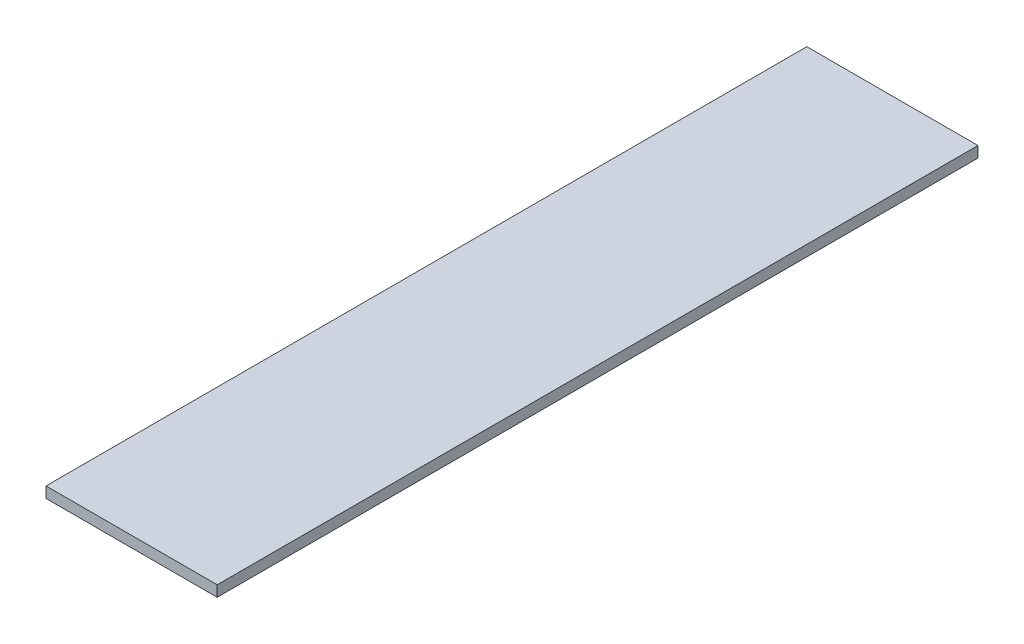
from build123d import *

# Parameters (mm, degrees)
SKETCH1_W           = 200.025
SKETCH1_H           = 889
BOSS_EXTRUDE1_DEPTH = 6.35


with BuildPart() as part:
    # Sketch1 → Boss-Extrude1 (new, symmetric)
    with BuildSketch(Plane(origin=(0, 0, 0), x_dir=(1, 0, 0), z_dir=(0, 1, 0))):
        Rectangle(SKETCH1_W, SKETCH1_H)
    extrude(amount=BOSS_EXTRUDE1_DEPTH, both=True)


solid = part.part
